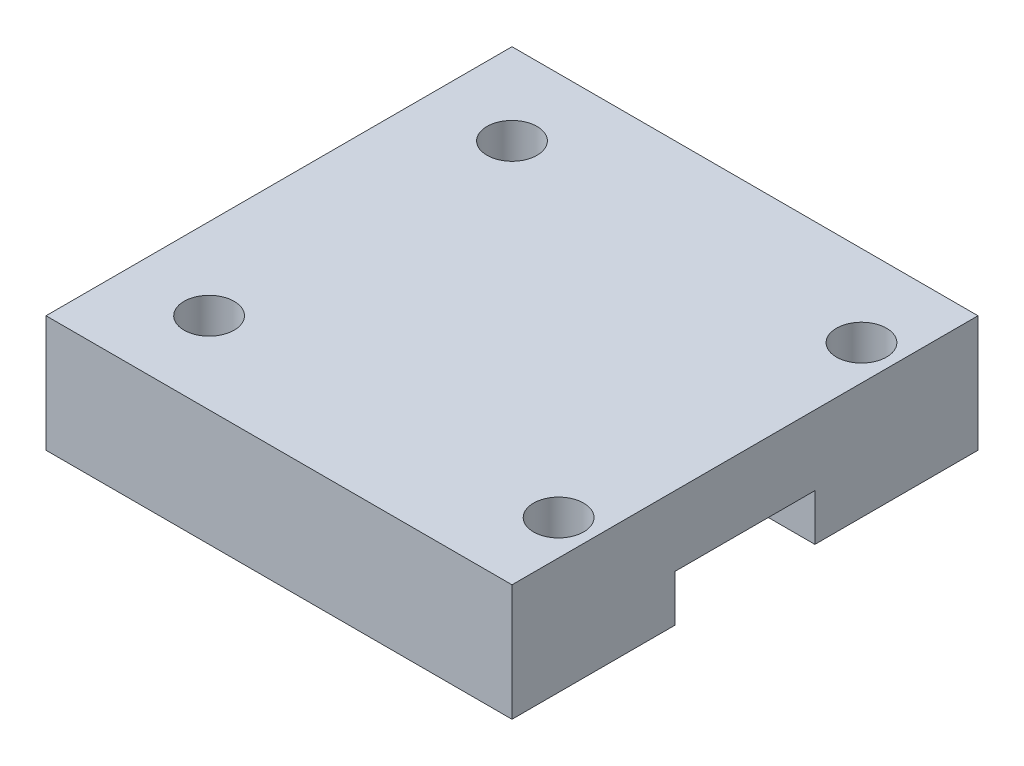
ISO-10303-21;
HEADER;
FILE_DESCRIPTION(('STEP AP214'),'2;1');
FILE_NAME('part.step','',(''),(''),'','','');
FILE_SCHEMA(('AUTOMOTIVE_DESIGN { 1 0 10303 214 1 1 1 1 }'));
ENDSEC;
DATA;
#1=APPLICATION_CONTEXT('core data for automotive mechanical design processes');
#2=APPLICATION_PROTOCOL_DEFINITION('international standard','automotive_design',2000,#1);
#3=PRODUCT_CONTEXT('',#1,'mechanical');
#4=PRODUCT('Part','Part','',(#3));
#5=PRODUCT_RELATED_PRODUCT_CATEGORY('part','',(#4));
#6=PRODUCT_DEFINITION_FORMATION('','',#4);
#7=PRODUCT_DEFINITION_CONTEXT('part definition',#1,'design');
#8=PRODUCT_DEFINITION('design','',#6,#7);
#9=PRODUCT_DEFINITION_SHAPE('','',#8);
#10=(LENGTH_UNIT() NAMED_UNIT(*) SI_UNIT(.MILLI.,.METRE.));
#11=(NAMED_UNIT(*) PLANE_ANGLE_UNIT() SI_UNIT($,.RADIAN.));
#12=(NAMED_UNIT(*) SI_UNIT($,.STERADIAN.) SOLID_ANGLE_UNIT());
#13=UNCERTAINTY_MEASURE_WITH_UNIT(LENGTH_MEASURE(1.E-05),#10,'distance_accuracy_value','');
#14=(GEOMETRIC_REPRESENTATION_CONTEXT(3) GLOBAL_UNCERTAINTY_ASSIGNED_CONTEXT((#13)) GLOBAL_UNIT_ASSIGNED_CONTEXT((#10,
#11,#12)) REPRESENTATION_CONTEXT('',''));
#15=CARTESIAN_POINT('',(0.,0.,0.));
#16=DIRECTION('',(0.,0.,1.));
#17=DIRECTION('',(1.,0.,0.));
#18=AXIS2_PLACEMENT_3D('',#15,#16,#17);
#19=CARTESIAN_POINT('',(0.,0.,0.));
#20=DIRECTION('',(0.,1.,0.));
#21=DIRECTION('',(0.,0.,1.));
#22=AXIS2_PLACEMENT_3D('',#19,#20,#21);
#23=PLANE('',#22);
#24=CARTESIAN_POINT('',(17.,0.,13.));
#25=DIRECTION('',(0.,1.,0.));
#26=DIRECTION('',(0.,0.,1.));
#27=AXIS2_PLACEMENT_3D('',#24,#25,#26);
#28=CIRCLE('',#27,2.15);
#29=CARTESIAN_POINT('',(17.,0.,15.15));
#30=VERTEX_POINT('',#29);
#31=EDGE_CURVE('E287',#30,#30,#28,.T.);
#32=ORIENTED_EDGE('',*,*,#31,.T.);
#33=EDGE_LOOP('',(#32));
#34=FACE_BOUND('',#33,.T.);
#35=CARTESIAN_POINT('',(-13.,0.,13.));
#36=DIRECTION('',(0.,1.,0.));
#37=DIRECTION('',(0.,0.,1.));
#38=AXIS2_PLACEMENT_3D('',#35,#36,#37);
#39=CIRCLE('',#38,2.15);
#40=CARTESIAN_POINT('',(-13.,0.,15.15));
#41=VERTEX_POINT('',#40);
#42=EDGE_CURVE('E297',#41,#41,#39,.T.);
#43=ORIENTED_EDGE('',*,*,#42,.T.);
#44=EDGE_LOOP('',(#43));
#45=FACE_BOUND('',#44,.T.);
#46=DIRECTION('',(0.,0.,1.));
#47=VECTOR('',#46,1.);
#48=CARTESIAN_POINT('',(-20.,0.,-20.));
#49=LINE('',#48,#47);
#50=CARTESIAN_POINT('',(-20.,0.,6.));
#51=VERTEX_POINT('',#50);
#52=CARTESIAN_POINT('',(-20.,0.,20.));
#53=VERTEX_POINT('',#52);
#54=EDGE_CURVE('E146',#51,#53,#49,.T.);
#55=ORIENTED_EDGE('',*,*,#54,.F.);
#56=DIRECTION('',(1.,0.,0.));
#57=VECTOR('',#56,1.);
#58=CARTESIAN_POINT('',(0.,0.,6.));
#59=LINE('',#58,#57);
#60=CARTESIAN_POINT('',(20.,0.,6.));
#61=VERTEX_POINT('',#60);
#62=EDGE_CURVE('E125',#51,#61,#59,.T.);
#63=ORIENTED_EDGE('',*,*,#62,.T.);
#64=DIRECTION('',(0.,0.,-1.));
#65=VECTOR('',#64,1.);
#66=CARTESIAN_POINT('',(20.,0.,-20.));
#67=LINE('',#66,#65);
#68=CARTESIAN_POINT('',(20.,0.,20.));
#69=VERTEX_POINT('',#68);
#70=EDGE_CURVE('E140',#69,#61,#67,.T.);
#71=ORIENTED_EDGE('',*,*,#70,.F.);
#72=DIRECTION('',(1.,0.,0.));
#73=VECTOR('',#72,1.);
#74=CARTESIAN_POINT('',(-20.,0.,20.));
#75=LINE('',#74,#73);
#76=EDGE_CURVE('E63',#53,#69,#75,.T.);
#77=ORIENTED_EDGE('',*,*,#76,.F.);
#78=EDGE_LOOP('',(#55,#63,#71,#77));
#79=FACE_BOUND('',#78,.T.);
#80=ADVANCED_FACE('F16',(#34,#45,#79),#23,.F.);
#81=CARTESIAN_POINT('',(-13.,0.,-13.));
#82=DIRECTION('',(0.,1.,0.));
#83=DIRECTION('',(0.,0.,1.));
#84=AXIS2_PLACEMENT_3D('',#81,#82,#83);
#85=CIRCLE('',#84,2.15);
#86=CARTESIAN_POINT('',(-13.,0.,-10.85));
#87=VERTEX_POINT('',#86);
#88=EDGE_CURVE('E303',#87,#87,#85,.T.);
#89=ORIENTED_EDGE('',*,*,#88,.T.);
#90=EDGE_LOOP('',(#89));
#91=FACE_BOUND('',#90,.T.);
#92=CARTESIAN_POINT('',(17.,0.,-13.));
#93=DIRECTION('',(0.,1.,0.));
#94=DIRECTION('',(0.,0.,1.));
#95=AXIS2_PLACEMENT_3D('',#92,#93,#94);
#96=CIRCLE('',#95,2.15);
#97=CARTESIAN_POINT('',(17.,0.,-10.85));
#98=VERTEX_POINT('',#97);
#99=EDGE_CURVE('E107',#98,#98,#96,.T.);
#100=ORIENTED_EDGE('',*,*,#99,.T.);
#101=EDGE_LOOP('',(#100));
#102=FACE_BOUND('',#101,.T.);
#103=CARTESIAN_POINT('',(20.,0.,-6.));
#104=VERTEX_POINT('',#103);
#105=CARTESIAN_POINT('',(20.,0.,-20.));
#106=VERTEX_POINT('',#105);
#107=EDGE_CURVE('E20',#104,#106,#67,.T.);
#108=ORIENTED_EDGE('',*,*,#107,.F.);
#109=DIRECTION('',(-1.,0.,0.));
#110=VECTOR('',#109,1.);
#111=CARTESIAN_POINT('',(0.,0.,-6.));
#112=LINE('',#111,#110);
#113=CARTESIAN_POINT('',(-20.,0.,-6.));
#114=VERTEX_POINT('',#113);
#115=EDGE_CURVE('E120',#104,#114,#112,.T.);
#116=ORIENTED_EDGE('',*,*,#115,.T.);
#117=CARTESIAN_POINT('',(-20.,0.,-20.));
#118=VERTEX_POINT('',#117);
#119=EDGE_CURVE('E113',#118,#114,#49,.T.);
#120=ORIENTED_EDGE('',*,*,#119,.F.);
#121=DIRECTION('',(-1.,0.,0.));
#122=VECTOR('',#121,1.);
#123=CARTESIAN_POINT('',(-20.,0.,-20.));
#124=LINE('',#123,#122);
#125=EDGE_CURVE('E136',#106,#118,#124,.T.);
#126=ORIENTED_EDGE('',*,*,#125,.F.);
#127=EDGE_LOOP('',(#108,#116,#120,#126));
#128=FACE_BOUND('',#127,.T.);
#129=ADVANCED_FACE('F162',(#91,#102,#128),#23,.F.);
#130=CARTESIAN_POINT('',(20.,10.,-20.));
#131=DIRECTION('',(-1.,0.,0.));
#132=DIRECTION('',(0.,0.,1.));
#133=AXIS2_PLACEMENT_3D('',#130,#131,#132);
#134=PLANE('',#133);
#135=ORIENTED_EDGE('',*,*,#70,.T.);
#136=DIRECTION('',(0.,1.,0.));
#137=VECTOR('',#136,1.);
#138=CARTESIAN_POINT('',(20.,10.,6.));
#139=LINE('',#138,#137);
#140=CARTESIAN_POINT('',(20.,4.,6.));
#141=VERTEX_POINT('',#140);
#142=EDGE_CURVE('E122',#61,#141,#139,.T.);
#143=ORIENTED_EDGE('',*,*,#142,.T.);
#144=DIRECTION('',(0.,0.,-1.));
#145=VECTOR('',#144,1.);
#146=CARTESIAN_POINT('',(20.,4.,-20.));
#147=LINE('',#146,#145);
#148=CARTESIAN_POINT('',(20.,4.,-6.));
#149=VERTEX_POINT('',#148);
#150=EDGE_CURVE('E101',#141,#149,#147,.T.);
#151=ORIENTED_EDGE('',*,*,#150,.T.);
#152=DIRECTION('',(0.,-1.,0.));
#153=VECTOR('',#152,1.);
#154=CARTESIAN_POINT('',(20.,10.,-6.));
#155=LINE('',#154,#153);
#156=EDGE_CURVE('E99',#149,#104,#155,.T.);
#157=ORIENTED_EDGE('',*,*,#156,.T.);
#158=ORIENTED_EDGE('',*,*,#107,.T.);
#159=DIRECTION('',(0.,-1.,0.));
#160=VECTOR('',#159,1.);
#161=CARTESIAN_POINT('',(20.,10.,-20.));
#162=LINE('',#161,#160);
#163=CARTESIAN_POINT('',(20.,10.,-20.));
#164=VERTEX_POINT('',#163);
#165=EDGE_CURVE('E26',#164,#106,#162,.T.);
#166=ORIENTED_EDGE('',*,*,#165,.F.);
#167=DIRECTION('',(0.,0.,-1.));
#168=VECTOR('',#167,1.);
#169=CARTESIAN_POINT('',(20.,10.,-20.));
#170=LINE('',#169,#168);
#171=CARTESIAN_POINT('',(20.,10.,20.));
#172=VERTEX_POINT('',#171);
#173=EDGE_CURVE('E128',#172,#164,#170,.T.);
#174=ORIENTED_EDGE('',*,*,#173,.F.);
#175=DIRECTION('',(0.,-1.,0.));
#176=VECTOR('',#175,1.);
#177=CARTESIAN_POINT('',(20.,10.,20.));
#178=LINE('',#177,#176);
#179=EDGE_CURVE('E133',#172,#69,#178,.T.);
#180=ORIENTED_EDGE('',*,*,#179,.T.);
#181=EDGE_LOOP('',(#135,#143,#151,#157,#158,#166,#174,#180));
#182=FACE_BOUND('',#181,.T.);
#183=ADVANCED_FACE('F18',(#182),#134,.F.);
#184=CARTESIAN_POINT('',(-20.,10.,-20.));
#185=DIRECTION('',(0.,0.,1.));
#186=DIRECTION('',(1.,0.,0.));
#187=AXIS2_PLACEMENT_3D('',#184,#185,#186);
#188=PLANE('',#187);
#189=ORIENTED_EDGE('',*,*,#125,.T.);
#190=DIRECTION('',(0.,-1.,0.));
#191=VECTOR('',#190,1.);
#192=CARTESIAN_POINT('',(-20.,10.,-20.));
#193=LINE('',#192,#191);
#194=CARTESIAN_POINT('',(-20.,10.,-20.));
#195=VERTEX_POINT('',#194);
#196=EDGE_CURVE('E153',#195,#118,#193,.T.);
#197=ORIENTED_EDGE('',*,*,#196,.F.);
#198=DIRECTION('',(-1.,0.,0.));
#199=VECTOR('',#198,1.);
#200=CARTESIAN_POINT('',(-20.,10.,-20.));
#201=LINE('',#200,#199);
#202=EDGE_CURVE('E71',#164,#195,#201,.T.);
#203=ORIENTED_EDGE('',*,*,#202,.F.);
#204=ORIENTED_EDGE('',*,*,#165,.T.);
#205=EDGE_LOOP('',(#189,#197,#203,#204));
#206=FACE_BOUND('',#205,.T.);
#207=ADVANCED_FACE('F156',(#206),#188,.F.);
#208=CARTESIAN_POINT('',(-20.,10.,-20.));
#209=DIRECTION('',(1.,0.,0.));
#210=DIRECTION('',(0.,0.,-1.));
#211=AXIS2_PLACEMENT_3D('',#208,#209,#210);
#212=PLANE('',#211);
#213=DIRECTION('',(0.,0.,-1.));
#214=VECTOR('',#213,1.);
#215=CARTESIAN_POINT('',(-20.,4.,-6.));
#216=LINE('',#215,#214);
#217=CARTESIAN_POINT('',(-20.,4.,6.));
#218=VERTEX_POINT('',#217);
#219=CARTESIAN_POINT('',(-20.,4.,-6.));
#220=VERTEX_POINT('',#219);
#221=EDGE_CURVE('E104',#218,#220,#216,.T.);
#222=ORIENTED_EDGE('',*,*,#221,.F.);
#223=DIRECTION('',(0.,-1.,0.));
#224=VECTOR('',#223,1.);
#225=CARTESIAN_POINT('',(-20.,10.,6.));
#226=LINE('',#225,#224);
#227=EDGE_CURVE('E11',#218,#51,#226,.T.);
#228=ORIENTED_EDGE('',*,*,#227,.T.);
#229=ORIENTED_EDGE('',*,*,#54,.T.);
#230=DIRECTION('',(0.,-1.,0.));
#231=VECTOR('',#230,1.);
#232=CARTESIAN_POINT('',(-20.,10.,20.));
#233=LINE('',#232,#231);
#234=CARTESIAN_POINT('',(-20.,10.,20.));
#235=VERTEX_POINT('',#234);
#236=EDGE_CURVE('E152',#235,#53,#233,.T.);
#237=ORIENTED_EDGE('',*,*,#236,.F.);
#238=DIRECTION('',(0.,0.,1.));
#239=VECTOR('',#238,1.);
#240=CARTESIAN_POINT('',(-20.,10.,-20.));
#241=LINE('',#240,#239);
#242=EDGE_CURVE('E131',#195,#235,#241,.T.);
#243=ORIENTED_EDGE('',*,*,#242,.F.);
#244=ORIENTED_EDGE('',*,*,#196,.T.);
#245=ORIENTED_EDGE('',*,*,#119,.T.);
#246=DIRECTION('',(0.,-1.,0.));
#247=VECTOR('',#246,1.);
#248=CARTESIAN_POINT('',(-20.,-4.,-6.));
#249=LINE('',#248,#247);
#250=EDGE_CURVE('E96',#220,#114,#249,.T.);
#251=ORIENTED_EDGE('',*,*,#250,.F.);
#252=EDGE_LOOP('',(#222,#228,#229,#237,#243,#244,#245,#251));
#253=FACE_BOUND('',#252,.T.);
#254=ADVANCED_FACE('F110',(#253),#212,.F.);
#255=CARTESIAN_POINT('',(-20.,10.,20.));
#256=DIRECTION('',(0.,0.,-1.));
#257=DIRECTION('',(-1.,0.,0.));
#258=AXIS2_PLACEMENT_3D('',#255,#256,#257);
#259=PLANE('',#258);
#260=ORIENTED_EDGE('',*,*,#76,.T.);
#261=ORIENTED_EDGE('',*,*,#179,.F.);
#262=DIRECTION('',(1.,0.,0.));
#263=VECTOR('',#262,1.);
#264=CARTESIAN_POINT('',(-20.,10.,20.));
#265=LINE('',#264,#263);
#266=EDGE_CURVE('E42',#235,#172,#265,.T.);
#267=ORIENTED_EDGE('',*,*,#266,.F.);
#268=ORIENTED_EDGE('',*,*,#236,.T.);
#269=EDGE_LOOP('',(#260,#261,#267,#268));
#270=FACE_BOUND('',#269,.T.);
#271=ADVANCED_FACE('F166',(#270),#259,.F.);
#272=CARTESIAN_POINT('',(0.,10.,0.));
#273=DIRECTION('',(0.,1.,0.));
#274=DIRECTION('',(0.,0.,1.));
#275=AXIS2_PLACEMENT_3D('',#272,#273,#274);
#276=PLANE('',#275);
#277=CARTESIAN_POINT('',(17.,10.,13.));
#278=DIRECTION('',(0.,1.,0.));
#279=DIRECTION('',(0.,0.,1.));
#280=AXIS2_PLACEMENT_3D('',#277,#278,#279);
#281=CIRCLE('',#280,2.15);
#282=CARTESIAN_POINT('',(17.,10.,15.15));
#283=VERTEX_POINT('',#282);
#284=EDGE_CURVE('E290',#283,#283,#281,.T.);
#285=ORIENTED_EDGE('',*,*,#284,.F.);
#286=EDGE_LOOP('',(#285));
#287=FACE_BOUND('',#286,.T.);
#288=CARTESIAN_POINT('',(-13.,10.,13.));
#289=DIRECTION('',(0.,1.,0.));
#290=DIRECTION('',(0.,0.,1.));
#291=AXIS2_PLACEMENT_3D('',#288,#289,#290);
#292=CIRCLE('',#291,2.15);
#293=CARTESIAN_POINT('',(-13.,10.,15.15));
#294=VERTEX_POINT('',#293);
#295=EDGE_CURVE('E292',#294,#294,#292,.T.);
#296=ORIENTED_EDGE('',*,*,#295,.F.);
#297=EDGE_LOOP('',(#296));
#298=FACE_BOUND('',#297,.T.);
#299=CARTESIAN_POINT('',(-13.,10.,-13.));
#300=DIRECTION('',(0.,1.,0.));
#301=DIRECTION('',(0.,0.,1.));
#302=AXIS2_PLACEMENT_3D('',#299,#300,#301);
#303=CIRCLE('',#302,2.15);
#304=CARTESIAN_POINT('',(-13.,10.,-10.85));
#305=VERTEX_POINT('',#304);
#306=EDGE_CURVE('E300',#305,#305,#303,.T.);
#307=ORIENTED_EDGE('',*,*,#306,.F.);
#308=EDGE_LOOP('',(#307));
#309=FACE_BOUND('',#308,.T.);
#310=CARTESIAN_POINT('',(17.,10.,-13.));
#311=DIRECTION('',(0.,1.,0.));
#312=DIRECTION('',(0.,0.,1.));
#313=AXIS2_PLACEMENT_3D('',#310,#311,#312);
#314=CIRCLE('',#313,2.15);
#315=CARTESIAN_POINT('',(17.,10.,-10.85));
#316=VERTEX_POINT('',#315);
#317=EDGE_CURVE('E306',#316,#316,#314,.T.);
#318=ORIENTED_EDGE('',*,*,#317,.F.);
#319=EDGE_LOOP('',(#318));
#320=FACE_BOUND('',#319,.T.);
#321=ORIENTED_EDGE('',*,*,#173,.T.);
#322=ORIENTED_EDGE('',*,*,#202,.T.);
#323=ORIENTED_EDGE('',*,*,#242,.T.);
#324=ORIENTED_EDGE('',*,*,#266,.T.);
#325=EDGE_LOOP('',(#321,#322,#323,#324));
#326=FACE_BOUND('',#325,.T.);
#327=ADVANCED_FACE('F171',(#287,#298,#309,#320,#326),#276,.T.);
#328=CARTESIAN_POINT('',(35.,-4.,6.));
#329=DIRECTION('',(0.,0.,1.));
#330=DIRECTION('',(1.,0.,0.));
#331=AXIS2_PLACEMENT_3D('',#328,#329,#330);
#332=PLANE('',#331);
#333=ORIENTED_EDGE('',*,*,#227,.F.);
#334=DIRECTION('',(-1.,0.,0.));
#335=VECTOR('',#334,1.);
#336=CARTESIAN_POINT('',(35.,4.,6.));
#337=LINE('',#336,#335);
#338=EDGE_CURVE('E33',#141,#218,#337,.T.);
#339=ORIENTED_EDGE('',*,*,#338,.F.);
#340=ORIENTED_EDGE('',*,*,#142,.F.);
#341=ORIENTED_EDGE('',*,*,#62,.F.);
#342=EDGE_LOOP('',(#333,#339,#340,#341));
#343=FACE_BOUND('',#342,.T.);
#344=ADVANCED_FACE('F169',(#343),#332,.F.);
#345=CARTESIAN_POINT('',(35.,-4.,-6.));
#346=DIRECTION('',(0.,0.,-1.));
#347=DIRECTION('',(-1.,0.,0.));
#348=AXIS2_PLACEMENT_3D('',#345,#346,#347);
#349=PLANE('',#348);
#350=ORIENTED_EDGE('',*,*,#156,.F.);
#351=DIRECTION('',(-1.,0.,0.));
#352=VECTOR('',#351,1.);
#353=CARTESIAN_POINT('',(35.,4.,-6.));
#354=LINE('',#353,#352);
#355=EDGE_CURVE('E93',#149,#220,#354,.T.);
#356=ORIENTED_EDGE('',*,*,#355,.T.);
#357=ORIENTED_EDGE('',*,*,#250,.T.);
#358=ORIENTED_EDGE('',*,*,#115,.F.);
#359=EDGE_LOOP('',(#350,#356,#357,#358));
#360=FACE_BOUND('',#359,.T.);
#361=ADVANCED_FACE('F94',(#360),#349,.F.);
#362=CARTESIAN_POINT('',(35.,4.,-6.));
#363=DIRECTION('',(0.,1.,0.));
#364=DIRECTION('',(0.,0.,1.));
#365=AXIS2_PLACEMENT_3D('',#362,#363,#364);
#366=PLANE('',#365);
#367=ORIENTED_EDGE('',*,*,#338,.T.);
#368=ORIENTED_EDGE('',*,*,#221,.T.);
#369=ORIENTED_EDGE('',*,*,#355,.F.);
#370=ORIENTED_EDGE('',*,*,#150,.F.);
#371=EDGE_LOOP('',(#367,#368,#369,#370));
#372=FACE_BOUND('',#371,.T.);
#373=ADVANCED_FACE('F105',(#372),#366,.F.);
#374=CARTESIAN_POINT('',(17.,10.,-13.));
#375=DIRECTION('',(0.,1.,0.));
#376=DIRECTION('',(0.,0.,1.));
#377=AXIS2_PLACEMENT_3D('',#374,#375,#376);
#378=CYLINDRICAL_SURFACE('',#377,2.15);
#379=ORIENTED_EDGE('',*,*,#99,.F.);
#380=EDGE_LOOP('',(#379));
#381=FACE_BOUND('',#380,.T.);
#382=ORIENTED_EDGE('',*,*,#317,.T.);
#383=EDGE_LOOP('',(#382));
#384=FACE_BOUND('',#383,.T.);
#385=ADVANCED_FACE('F243',(#381,#384),#378,.F.);
#386=CARTESIAN_POINT('',(-13.,10.,-13.));
#387=DIRECTION('',(0.,1.,0.));
#388=DIRECTION('',(0.,0.,1.));
#389=AXIS2_PLACEMENT_3D('',#386,#387,#388);
#390=CYLINDRICAL_SURFACE('',#389,2.15);
#391=ORIENTED_EDGE('',*,*,#88,.F.);
#392=EDGE_LOOP('',(#391));
#393=FACE_BOUND('',#392,.T.);
#394=ORIENTED_EDGE('',*,*,#306,.T.);
#395=EDGE_LOOP('',(#394));
#396=FACE_BOUND('',#395,.T.);
#397=ADVANCED_FACE('F252',(#393,#396),#390,.F.);
#398=CARTESIAN_POINT('',(-13.,10.,13.));
#399=DIRECTION('',(0.,1.,0.));
#400=DIRECTION('',(0.,0.,1.));
#401=AXIS2_PLACEMENT_3D('',#398,#399,#400);
#402=CYLINDRICAL_SURFACE('',#401,2.15);
#403=ORIENTED_EDGE('',*,*,#42,.F.);
#404=EDGE_LOOP('',(#403));
#405=FACE_BOUND('',#404,.T.);
#406=ORIENTED_EDGE('',*,*,#295,.T.);
#407=EDGE_LOOP('',(#406));
#408=FACE_BOUND('',#407,.T.);
#409=ADVANCED_FACE('F262',(#405,#408),#402,.F.);
#410=CARTESIAN_POINT('',(17.,10.,13.));
#411=DIRECTION('',(0.,1.,0.));
#412=DIRECTION('',(0.,0.,1.));
#413=AXIS2_PLACEMENT_3D('',#410,#411,#412);
#414=CYLINDRICAL_SURFACE('',#413,2.15);
#415=ORIENTED_EDGE('',*,*,#31,.F.);
#416=EDGE_LOOP('',(#415));
#417=FACE_BOUND('',#416,.T.);
#418=ORIENTED_EDGE('',*,*,#284,.T.);
#419=EDGE_LOOP('',(#418));
#420=FACE_BOUND('',#419,.T.);
#421=ADVANCED_FACE('F272',(#417,#420),#414,.F.);
#422=CLOSED_SHELL('',(#80,#129,#183,#207,#254,#271,#327,#344,#361,#373,#385,#397,#409,#421));
#423=MANIFOLD_SOLID_BREP('B1',#422);
#424=ADVANCED_BREP_SHAPE_REPRESENTATION('',(#18,#423),#14);
#425=SHAPE_DEFINITION_REPRESENTATION(#9,#424);
ENDSEC;
END-ISO-10303-21;
